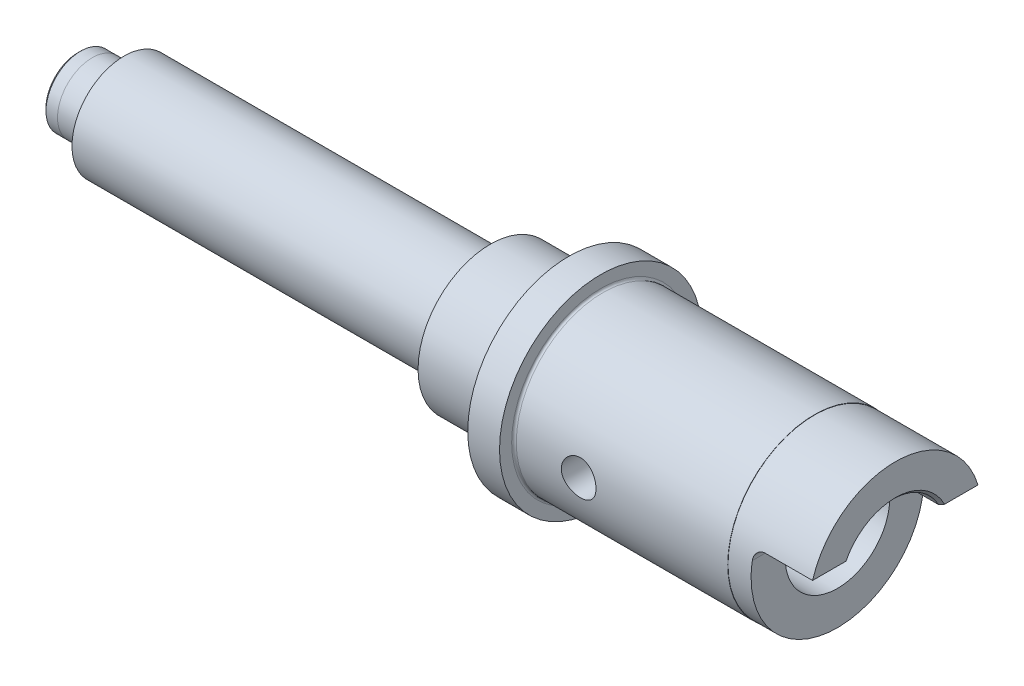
ISO-10303-21;
HEADER;
FILE_DESCRIPTION(('STEP AP214'),'2;1');
FILE_NAME('part.step','',(''),(''),'','','');
FILE_SCHEMA(('AUTOMOTIVE_DESIGN { 1 0 10303 214 1 1 1 1 }'));
ENDSEC;
DATA;
#1=APPLICATION_CONTEXT('core data for automotive mechanical design processes');
#2=APPLICATION_PROTOCOL_DEFINITION('international standard','automotive_design',2000,#1);
#3=PRODUCT_CONTEXT('',#1,'mechanical');
#4=PRODUCT('Part','Part','',(#3));
#5=PRODUCT_RELATED_PRODUCT_CATEGORY('part','',(#4));
#6=PRODUCT_DEFINITION_FORMATION('','',#4);
#7=PRODUCT_DEFINITION_CONTEXT('part definition',#1,'design');
#8=PRODUCT_DEFINITION('design','',#6,#7);
#9=PRODUCT_DEFINITION_SHAPE('','',#8);
#10=(LENGTH_UNIT() NAMED_UNIT(*) SI_UNIT(.MILLI.,.METRE.));
#11=(NAMED_UNIT(*) PLANE_ANGLE_UNIT() SI_UNIT($,.RADIAN.));
#12=(NAMED_UNIT(*) SI_UNIT($,.STERADIAN.) SOLID_ANGLE_UNIT());
#13=UNCERTAINTY_MEASURE_WITH_UNIT(LENGTH_MEASURE(1.E-05),#10,'distance_accuracy_value','');
#14=(GEOMETRIC_REPRESENTATION_CONTEXT(3) GLOBAL_UNCERTAINTY_ASSIGNED_CONTEXT((#13)) GLOBAL_UNIT_ASSIGNED_CONTEXT((#10,
#11,#12)) REPRESENTATION_CONTEXT('',''));
#15=CARTESIAN_POINT('',(0.,0.,0.));
#16=DIRECTION('',(0.,0.,1.));
#17=DIRECTION('',(1.,0.,0.));
#18=AXIS2_PLACEMENT_3D('',#15,#16,#17);
#19=CARTESIAN_POINT('',(0.,0.,0.));
#20=DIRECTION('',(1.,0.,0.));
#21=DIRECTION('',(0.,0.,-1.));
#22=AXIS2_PLACEMENT_3D('',#19,#20,#21);
#23=PLANE('',#22);
#24=CARTESIAN_POINT('',(0.,0.,0.));
#25=DIRECTION('',(-1.,0.,0.));
#26=DIRECTION('',(0.,0.,1.));
#27=AXIS2_PLACEMENT_3D('',#24,#25,#26);
#28=CIRCLE('',#27,5.495);
#29=CARTESIAN_POINT('',(0.,0.,5.495));
#30=VERTEX_POINT('',#29);
#31=EDGE_CURVE('E176',#30,#30,#28,.T.);
#32=ORIENTED_EDGE('',*,*,#31,.T.);
#33=EDGE_LOOP('',(#32));
#34=FACE_BOUND('',#33,.T.);
#35=ADVANCED_FACE('F43',(#34),#23,.F.);
#36=CARTESIAN_POINT('',(0.5,0.,0.));
#37=DIRECTION('',(1.,0.,0.));
#38=DIRECTION('',(0.,0.,-1.));
#39=AXIS2_PLACEMENT_3D('',#36,#37,#38);
#40=CONICAL_SURFACE('',#39,5.995,0.785398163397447);
#41=ORIENTED_EDGE('',*,*,#31,.F.);
#42=EDGE_LOOP('',(#41));
#43=FACE_BOUND('',#42,.T.);
#44=CARTESIAN_POINT('',(0.5,0.,0.));
#45=DIRECTION('',(-1.,0.,0.));
#46=DIRECTION('',(0.,0.,1.));
#47=AXIS2_PLACEMENT_3D('',#44,#45,#46);
#48=CIRCLE('',#47,5.995);
#49=CARTESIAN_POINT('',(0.5,0.,5.995));
#50=VERTEX_POINT('',#49);
#51=EDGE_CURVE('E173',#50,#50,#48,.T.);
#52=ORIENTED_EDGE('',*,*,#51,.T.);
#53=EDGE_LOOP('',(#52));
#54=FACE_BOUND('',#53,.T.);
#55=ADVANCED_FACE('F272',(#43,#54),#40,.T.);
#56=CARTESIAN_POINT('',(2.5,0.,0.));
#57=DIRECTION('',(1.,0.,0.));
#58=DIRECTION('',(0.,0.,-1.));
#59=AXIS2_PLACEMENT_3D('',#56,#57,#58);
#60=CONICAL_SURFACE('',#59,6.,0.00249999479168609);
#61=ORIENTED_EDGE('',*,*,#51,.F.);
#62=EDGE_LOOP('',(#61));
#63=FACE_BOUND('',#62,.T.);
#64=CARTESIAN_POINT('',(2.5,0.,0.));
#65=DIRECTION('',(-1.,0.,0.));
#66=DIRECTION('',(0.,0.,1.));
#67=AXIS2_PLACEMENT_3D('',#64,#65,#66);
#68=CIRCLE('',#67,6.);
#69=CARTESIAN_POINT('',(2.5,0.,6.));
#70=VERTEX_POINT('',#69);
#71=EDGE_CURVE('E170',#70,#70,#68,.T.);
#72=ORIENTED_EDGE('',*,*,#71,.T.);
#73=EDGE_LOOP('',(#72));
#74=FACE_BOUND('',#73,.T.);
#75=ADVANCED_FACE('F268',(#63,#74),#60,.T.);
#76=CARTESIAN_POINT('',(-32.8531956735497,0.,0.));
#77=DIRECTION('',(-1.,0.,0.));
#78=DIRECTION('',(0.,0.,1.));
#79=AXIS2_PLACEMENT_3D('',#76,#77,#78);
#80=CYLINDRICAL_SURFACE('',#79,6.);
#81=CARTESIAN_POINT('',(7.2,0.,0.));
#82=DIRECTION('',(1.,0.,0.));
#83=DIRECTION('',(0.,0.,-1.));
#84=AXIS2_PLACEMENT_3D('',#81,#82,#83);
#85=CIRCLE('',#84,6.);
#86=CARTESIAN_POINT('',(7.2,0.,-6.));
#87=VERTEX_POINT('',#86);
#88=EDGE_CURVE('E401',#87,#87,#85,.F.);
#89=ORIENTED_EDGE('',*,*,#88,.T.);
#90=EDGE_LOOP('',(#89));
#91=FACE_BOUND('',#90,.T.);
#92=ORIENTED_EDGE('',*,*,#71,.F.);
#93=EDGE_LOOP('',(#92));
#94=FACE_BOUND('',#93,.T.);
#95=ADVANCED_FACE('F264',(#91,#94),#80,.T.);
#96=CARTESIAN_POINT('',(8.,6.,0.));
#97=DIRECTION('',(1.,0.,0.));
#98=DIRECTION('',(0.,0.,-1.));
#99=AXIS2_PLACEMENT_3D('',#96,#97,#98);
#100=PLANE('',#99);
#101=CARTESIAN_POINT('',(8.,0.,0.));
#102=DIRECTION('',(1.,0.,0.));
#103=DIRECTION('',(0.,0.,-1.));
#104=AXIS2_PLACEMENT_3D('',#101,#102,#103);
#105=CIRCLE('',#104,6.8);
#106=CARTESIAN_POINT('',(8.,0.,-6.8));
#107=VERTEX_POINT('',#106);
#108=EDGE_CURVE('E399',#107,#107,#105,.T.);
#109=ORIENTED_EDGE('',*,*,#108,.T.);
#110=EDGE_LOOP('',(#109));
#111=FACE_BOUND('',#110,.T.);
#112=CARTESIAN_POINT('',(8.,0.,0.));
#113=DIRECTION('',(-1.,0.,0.));
#114=DIRECTION('',(0.,0.,1.));
#115=AXIS2_PLACEMENT_3D('',#112,#113,#114);
#116=CIRCLE('',#115,9.);
#117=CARTESIAN_POINT('',(8.,0.,9.));
#118=VERTEX_POINT('',#117);
#119=EDGE_CURVE('E167',#118,#118,#116,.T.);
#120=ORIENTED_EDGE('',*,*,#119,.T.);
#121=EDGE_LOOP('',(#120));
#122=FACE_BOUND('',#121,.T.);
#123=ADVANCED_FACE('F260',(#111,#122),#100,.F.);
#124=CARTESIAN_POINT('',(-32.8531956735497,0.,0.));
#125=DIRECTION('',(-1.,0.,0.));
#126=DIRECTION('',(0.,0.,1.));
#127=AXIS2_PLACEMENT_3D('',#124,#125,#126);
#128=CYLINDRICAL_SURFACE('',#127,9.);
#129=CARTESIAN_POINT('',(70.6,0.,0.));
#130=DIRECTION('',(1.,0.,0.));
#131=DIRECTION('',(0.,0.,-1.));
#132=AXIS2_PLACEMENT_3D('',#129,#130,#131);
#133=CIRCLE('',#132,9.);
#134=CARTESIAN_POINT('',(70.6,0.,-9.));
#135=VERTEX_POINT('',#134);
#136=EDGE_CURVE('E396',#135,#135,#133,.F.);
#137=ORIENTED_EDGE('',*,*,#136,.T.);
#138=EDGE_LOOP('',(#137));
#139=FACE_BOUND('',#138,.T.);
#140=ORIENTED_EDGE('',*,*,#119,.F.);
#141=EDGE_LOOP('',(#140));
#142=FACE_BOUND('',#141,.T.);
#143=ADVANCED_FACE('F256',(#139,#142),#128,.T.);
#144=CARTESIAN_POINT('',(71.4,9.,0.));
#145=DIRECTION('',(1.,0.,0.));
#146=DIRECTION('',(0.,0.,-1.));
#147=AXIS2_PLACEMENT_3D('',#144,#145,#146);
#148=PLANE('',#147);
#149=CARTESIAN_POINT('',(71.4,0.,0.));
#150=DIRECTION('',(1.,0.,0.));
#151=DIRECTION('',(0.,0.,-1.));
#152=AXIS2_PLACEMENT_3D('',#149,#150,#151);
#153=CIRCLE('',#152,9.8);
#154=CARTESIAN_POINT('',(71.4,0.,-9.8));
#155=VERTEX_POINT('',#154);
#156=EDGE_CURVE('E393',#155,#155,#153,.T.);
#157=ORIENTED_EDGE('',*,*,#156,.T.);
#158=EDGE_LOOP('',(#157));
#159=FACE_BOUND('',#158,.T.);
#160=CARTESIAN_POINT('',(71.4,0.,0.));
#161=DIRECTION('',(-1.,0.,0.));
#162=DIRECTION('',(0.,0.,1.));
#163=AXIS2_PLACEMENT_3D('',#160,#161,#162);
#164=CIRCLE('',#163,12.5);
#165=CARTESIAN_POINT('',(71.4,0.,12.5));
#166=VERTEX_POINT('',#165);
#167=EDGE_CURVE('E164',#166,#166,#164,.T.);
#168=ORIENTED_EDGE('',*,*,#167,.T.);
#169=EDGE_LOOP('',(#168));
#170=FACE_BOUND('',#169,.T.);
#171=ADVANCED_FACE('F252',(#159,#170),#148,.F.);
#172=CARTESIAN_POINT('',(-32.8531956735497,0.,0.));
#173=DIRECTION('',(-1.,0.,0.));
#174=DIRECTION('',(0.,0.,1.));
#175=AXIS2_PLACEMENT_3D('',#172,#173,#174);
#176=CYLINDRICAL_SURFACE('',#175,12.5);
#177=CARTESIAN_POINT('',(84.8,0.,0.));
#178=DIRECTION('',(1.,0.,0.));
#179=DIRECTION('',(0.,0.,-1.));
#180=AXIS2_PLACEMENT_3D('',#177,#178,#179);
#181=CIRCLE('',#180,12.5);
#182=CARTESIAN_POINT('',(84.8,0.,-12.5));
#183=VERTEX_POINT('',#182);
#184=EDGE_CURVE('E390',#183,#183,#181,.F.);
#185=ORIENTED_EDGE('',*,*,#184,.T.);
#186=EDGE_LOOP('',(#185));
#187=FACE_BOUND('',#186,.T.);
#188=ORIENTED_EDGE('',*,*,#167,.F.);
#189=EDGE_LOOP('',(#188));
#190=FACE_BOUND('',#189,.T.);
#191=ADVANCED_FACE('F248',(#187,#190),#176,.T.);
#192=CARTESIAN_POINT('',(85.,12.5,0.));
#193=DIRECTION('',(1.,0.,0.));
#194=DIRECTION('',(0.,0.,-1.));
#195=AXIS2_PLACEMENT_3D('',#192,#193,#194);
#196=PLANE('',#195);
#197=CARTESIAN_POINT('',(85.,0.,0.));
#198=DIRECTION('',(1.,0.,0.));
#199=DIRECTION('',(0.,0.,-1.));
#200=AXIS2_PLACEMENT_3D('',#197,#198,#199);
#201=CIRCLE('',#200,12.7);
#202=CARTESIAN_POINT('',(85.,0.,-12.7));
#203=VERTEX_POINT('',#202);
#204=EDGE_CURVE('E387',#203,#203,#201,.T.);
#205=ORIENTED_EDGE('',*,*,#204,.T.);
#206=EDGE_LOOP('',(#205));
#207=FACE_BOUND('',#206,.T.);
#208=CARTESIAN_POINT('',(85.,0.,0.));
#209=DIRECTION('',(-1.,0.,0.));
#210=DIRECTION('',(0.,0.,1.));
#211=AXIS2_PLACEMENT_3D('',#208,#209,#210);
#212=CIRCLE('',#211,17.5);
#213=CARTESIAN_POINT('',(85.,0.,17.5));
#214=VERTEX_POINT('',#213);
#215=EDGE_CURVE('E161',#214,#214,#212,.T.);
#216=ORIENTED_EDGE('',*,*,#215,.T.);
#217=EDGE_LOOP('',(#216));
#218=FACE_BOUND('',#217,.T.);
#219=ADVANCED_FACE('F244',(#207,#218),#196,.F.);
#220=CARTESIAN_POINT('',(-32.8531956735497,0.,0.));
#221=DIRECTION('',(-1.,0.,0.));
#222=DIRECTION('',(0.,0.,1.));
#223=AXIS2_PLACEMENT_3D('',#220,#221,#222);
#224=CYLINDRICAL_SURFACE('',#223,17.5);
#225=ORIENTED_EDGE('',*,*,#215,.F.);
#226=EDGE_LOOP('',(#225));
#227=FACE_BOUND('',#226,.T.);
#228=CARTESIAN_POINT('',(90.5,0.,0.));
#229=DIRECTION('',(-1.,0.,0.));
#230=DIRECTION('',(0.,0.,1.));
#231=AXIS2_PLACEMENT_3D('',#228,#229,#230);
#232=CIRCLE('',#231,17.5);
#233=CARTESIAN_POINT('',(90.5,0.,17.5));
#234=VERTEX_POINT('',#233);
#235=EDGE_CURVE('E158',#234,#234,#232,.T.);
#236=ORIENTED_EDGE('',*,*,#235,.T.);
#237=EDGE_LOOP('',(#236));
#238=FACE_BOUND('',#237,.T.);
#239=ADVANCED_FACE('F240',(#227,#238),#224,.T.);
#240=CARTESIAN_POINT('',(90.5,17.5,0.));
#241=DIRECTION('',(-1.,0.,0.));
#242=DIRECTION('',(0.,0.,1.));
#243=AXIS2_PLACEMENT_3D('',#240,#241,#242);
#244=PLANE('',#243);
#245=CARTESIAN_POINT('',(90.5,0.,0.));
#246=DIRECTION('',(-1.,0.,0.));
#247=DIRECTION('',(0.,0.,1.));
#248=AXIS2_PLACEMENT_3D('',#245,#246,#247);
#249=CIRCLE('',#248,15.4);
#250=CARTESIAN_POINT('',(90.5,0.,15.4));
#251=VERTEX_POINT('',#250);
#252=EDGE_CURVE('E382',#251,#251,#249,.T.);
#253=ORIENTED_EDGE('',*,*,#252,.T.);
#254=EDGE_LOOP('',(#253));
#255=FACE_BOUND('',#254,.T.);
#256=ORIENTED_EDGE('',*,*,#235,.F.);
#257=EDGE_LOOP('',(#256));
#258=FACE_BOUND('',#257,.T.);
#259=ADVANCED_FACE('F234',(#255,#258),#244,.F.);
#260=CARTESIAN_POINT('',(-32.8531956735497,0.,0.));
#261=DIRECTION('',(-1.,0.,0.));
#262=DIRECTION('',(0.,0.,1.));
#263=AXIS2_PLACEMENT_3D('',#260,#261,#262);
#264=CYLINDRICAL_SURFACE('',#263,15.);
#265=CARTESIAN_POINT('',(90.9,0.,0.));
#266=DIRECTION('',(-1.,0.,0.));
#267=DIRECTION('',(0.,0.,1.));
#268=AXIS2_PLACEMENT_3D('',#265,#266,#267);
#269=CIRCLE('',#268,15.);
#270=CARTESIAN_POINT('',(90.9,0.,15.));
#271=VERTEX_POINT('',#270);
#272=EDGE_CURVE('E379',#271,#271,#269,.F.);
#273=ORIENTED_EDGE('',*,*,#272,.T.);
#274=EDGE_LOOP('',(#273));
#275=FACE_BOUND('',#274,.T.);
#276=CARTESIAN_POINT('',(104.7,0.,15.));
#277=CARTESIAN_POINT('',(104.699993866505,-0.166730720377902,14.9999969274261));
#278=CARTESIAN_POINT('',(104.686053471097,-0.333538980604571,14.9971915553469));
#279=CARTESIAN_POINT('',(104.630704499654,-0.662440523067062,14.9862709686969));
#280=CARTESIAN_POINT('',(104.589274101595,-0.82452995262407,14.9781515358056));
#281=CARTESIAN_POINT('',(104.480276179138,-1.13919091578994,14.9575094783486));
#282=CARTESIAN_POINT('',(104.412733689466,-1.29177140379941,14.9449910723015));
#283=CARTESIAN_POINT('',(104.253503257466,-1.58342396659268,14.9169119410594));
#284=CARTESIAN_POINT('',(104.161816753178,-1.72249684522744,14.9013513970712));
#285=CARTESIAN_POINT('',(103.955584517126,-1.9850804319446,14.8686649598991));
#286=CARTESIAN_POINT('',(103.840774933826,-2.10838185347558,14.8515223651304));
#287=CARTESIAN_POINT('',(103.592122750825,-2.33411026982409,14.8177254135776));
#288=CARTESIAN_POINT('',(103.458278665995,-2.43653563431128,14.8010710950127));
#289=CARTESIAN_POINT('',(103.173851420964,-2.61849526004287,14.7699732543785));
#290=CARTESIAN_POINT('',(103.023127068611,-2.6978128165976,14.7555512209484));
#291=CARTESIAN_POINT('',(102.710154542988,-2.82991699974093,14.7307880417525));
#292=CARTESIAN_POINT('',(102.547907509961,-2.88270624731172,14.7204464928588));
#293=CARTESIAN_POINT('',(102.218746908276,-2.95957589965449,14.7051841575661));
#294=CARTESIAN_POINT('',(102.051922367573,-2.98402349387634,14.7001941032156));
#295=CARTESIAN_POINT('',(101.716470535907,-3.00465638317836,14.6959912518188));
#296=CARTESIAN_POINT('',(101.54784343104,-3.00084456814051,14.6967778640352));
#297=CARTESIAN_POINT('',(101.216259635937,-2.96536371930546,14.7039765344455));
#298=CARTESIAN_POINT('',(101.053255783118,-2.93411562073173,14.7103035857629));
#299=CARTESIAN_POINT('',(100.734851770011,-2.84531365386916,14.7277363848));
#300=CARTESIAN_POINT('',(100.579451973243,-2.78775852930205,14.7388423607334));
#301=CARTESIAN_POINT('',(100.279454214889,-2.64757435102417,14.7646685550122));
#302=CARTESIAN_POINT('',(100.134936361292,-2.56477845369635,14.7794126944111));
#303=CARTESIAN_POINT('',(99.8616874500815,-2.37658072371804,14.8108385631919));
#304=CARTESIAN_POINT('',(99.7329582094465,-2.27117629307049,14.827520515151));
#305=CARTESIAN_POINT('',(99.4925117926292,-2.03849980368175,14.8613106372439));
#306=CARTESIAN_POINT('',(99.3811422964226,-1.91086848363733,14.8784210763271));
#307=CARTESIAN_POINT('',(99.1813384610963,-1.63855507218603,14.9108654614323));
#308=CARTESIAN_POINT('',(99.0929044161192,-1.49387276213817,14.9261993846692));
#309=CARTESIAN_POINT('',(98.9414174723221,-1.19117816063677,14.9534007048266));
#310=CARTESIAN_POINT('',(98.8784043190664,-1.0331454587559,14.9652626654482));
#311=CARTESIAN_POINT('',(98.7799185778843,-0.708446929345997,14.9841422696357));
#312=CARTESIAN_POINT('',(98.7444426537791,-0.54178215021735,14.9911605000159));
#313=CARTESIAN_POINT('',(98.7025306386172,-0.207538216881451,14.999480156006));
#314=CARTESIAN_POINT('',(98.6956187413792,-0.0400209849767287,15.0008752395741));
#315=CARTESIAN_POINT('',(98.7097495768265,0.293774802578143,14.9980515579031));
#316=CARTESIAN_POINT('',(98.7307907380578,0.460053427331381,14.9938331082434));
#317=CARTESIAN_POINT('',(98.7998351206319,0.785116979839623,14.9803149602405));
#318=CARTESIAN_POINT('',(98.8475942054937,0.943955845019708,14.9710612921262));
#319=CARTESIAN_POINT('',(98.9684519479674,1.251370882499,14.948506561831));
#320=CARTESIAN_POINT('',(99.0415525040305,1.39994628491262,14.9352051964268));
#321=CARTESIAN_POINT('',(99.2120474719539,1.68462352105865,14.9057973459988));
#322=CARTESIAN_POINT('',(99.3097283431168,1.82055038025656,14.8896585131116));
#323=CARTESIAN_POINT('',(99.5262275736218,2.07425405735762,14.8564420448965));
#324=CARTESIAN_POINT('',(99.6450481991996,2.19202892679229,14.8393643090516));
#325=CARTESIAN_POINT('',(99.9026200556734,2.40792177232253,14.8058791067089));
#326=CARTESIAN_POINT('',(100.041647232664,2.50571310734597,14.7894858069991));
#327=CARTESIAN_POINT('',(100.33443408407,2.67655626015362,14.7595257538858));
#328=CARTESIAN_POINT('',(100.488193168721,2.74960906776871,14.7459588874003));
#329=CARTESIAN_POINT('',(100.805304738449,2.86845552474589,14.7233022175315));
#330=CARTESIAN_POINT('',(100.968602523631,2.91439049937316,14.7141892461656));
#331=CARTESIAN_POINT('',(101.300800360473,2.9781259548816,14.7014231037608));
#332=CARTESIAN_POINT('',(101.469699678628,2.99593010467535,14.6977692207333));
#333=CARTESIAN_POINT('',(101.805026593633,3.00276273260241,14.6963744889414));
#334=CARTESIAN_POINT('',(101.971443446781,2.99230736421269,14.698527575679));
#335=CARTESIAN_POINT('',(102.300094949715,2.94405691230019,14.7082672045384));
#336=CARTESIAN_POINT('',(102.462329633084,2.9062620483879,14.7158537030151));
#337=CARTESIAN_POINT('',(102.777683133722,2.80463570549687,14.7355579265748));
#338=CARTESIAN_POINT('',(102.930823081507,2.74086752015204,14.7476646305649));
#339=CARTESIAN_POINT('',(103.224311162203,2.58916393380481,14.7750514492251));
#340=CARTESIAN_POINT('',(103.364658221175,2.50122650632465,14.7903318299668));
#341=CARTESIAN_POINT('',(103.631146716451,2.30191774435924,14.8226688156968));
#342=CARTESIAN_POINT('',(103.757006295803,2.19017366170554,14.839751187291));
#343=CARTESIAN_POINT('',(103.988358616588,1.94719310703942,14.8735824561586));
#344=CARTESIAN_POINT('',(104.093846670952,1.81595216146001,14.8903312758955));
#345=CARTESIAN_POINT('',(104.282503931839,1.53605288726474,14.9218149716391));
#346=CARTESIAN_POINT('',(104.36542800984,1.38722665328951,14.9365269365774));
#347=CARTESIAN_POINT('',(104.50495836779,1.0774990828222,14.96205375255));
#348=CARTESIAN_POINT('',(104.561588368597,0.916608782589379,14.9728721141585));
#349=CARTESIAN_POINT('',(104.635955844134,0.629464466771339,14.9872911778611));
#350=CARTESIAN_POINT('',(104.659929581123,0.504844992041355,14.9920290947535));
#351=CARTESIAN_POINT('',(104.691953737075,0.253498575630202,14.9983846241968));
#352=CARTESIAN_POINT('',(104.700004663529,0.126771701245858,15.0000023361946));
#353=CARTESIAN_POINT('',(104.7,0.,15.));
#354=B_SPLINE_CURVE_WITH_KNOTS('',3,(#276,#277,#278,#279,#280,#281,#282,#283,#284,#285,#286,
#287,#288,#289,#290,#291,#292,#293,#294,#295,#296,#297,#298,#299,#300,#301,#302,#303,#304,#305,
#306,#307,#308,#309,#310,#311,#312,#313,#314,#315,#316,#317,#318,#319,#320,#321,#322,#323,#324,
#325,#326,#327,#328,#329,#330,#331,#332,#333,#334,#335,#336,#337,#338,#339,#340,#341,#342,#343,
#344,#345,#346,#347,#348,#349,#350,#351,#352,#353),.UNSPECIFIED.,.T.,.F.,(4,2,2,2,2,2,2,2,2,2,2,
2,2,2,2,2,2,2,2,2,2,2,2,2,2,2,2,2,2,2,2,2,2,2,2,2,2,2,4),(0.,0.499728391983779,
0.999853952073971,1.49950120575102,1.99911870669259,2.50479801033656,3.0105167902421,
3.52083585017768,4.03110448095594,4.53468555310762,5.03821512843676,5.53415181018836,
6.0301121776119,6.52942470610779,7.02879464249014,7.53714757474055,8.04550702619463,
8.55465824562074,9.0637477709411,9.56432207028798,10.0648682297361,10.5609136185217,
11.0569961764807,11.5591519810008,12.0613616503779,12.5712188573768,13.081055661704,
13.5882114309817,14.0953010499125,14.5931916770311,15.0910783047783,15.5877588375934,
16.0844810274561,16.5896422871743,17.094919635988,17.6054849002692,18.1155886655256,
18.4955632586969,18.8755257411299),.UNSPECIFIED.);
#355=CARTESIAN_POINT('',(104.7,0.,15.));
#356=VERTEX_POINT('',#355);
#357=EDGE_CURVE('E224',#356,#356,#354,.T.);
#358=ORIENTED_EDGE('',*,*,#357,.T.);
#359=EDGE_LOOP('',(#358));
#360=FACE_BOUND('',#359,.T.);
#361=CARTESIAN_POINT('',(104.7,0.,-15.));
#362=CARTESIAN_POINT('',(104.699993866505,0.1667307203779,-14.9999969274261));
#363=CARTESIAN_POINT('',(104.686053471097,0.333538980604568,-14.9971915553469));
#364=CARTESIAN_POINT('',(104.630704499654,0.662440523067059,-14.9862709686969));
#365=CARTESIAN_POINT('',(104.589274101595,0.824529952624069,-14.9781515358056));
#366=CARTESIAN_POINT('',(104.480276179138,1.13919091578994,-14.9575094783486));
#367=CARTESIAN_POINT('',(104.412733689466,1.2917714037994,-14.9449910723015));
#368=CARTESIAN_POINT('',(104.253503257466,1.58342396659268,-14.9169119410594));
#369=CARTESIAN_POINT('',(104.161816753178,1.72249684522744,-14.9013513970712));
#370=CARTESIAN_POINT('',(103.955584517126,1.9850804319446,-14.8686649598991));
#371=CARTESIAN_POINT('',(103.840774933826,2.10838185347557,-14.8515223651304));
#372=CARTESIAN_POINT('',(103.592122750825,2.33411026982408,-14.8177254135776));
#373=CARTESIAN_POINT('',(103.458278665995,2.43653563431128,-14.8010710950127));
#374=CARTESIAN_POINT('',(103.173851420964,2.61849526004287,-14.7699732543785));
#375=CARTESIAN_POINT('',(103.023127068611,2.69781281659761,-14.7555512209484));
#376=CARTESIAN_POINT('',(102.710154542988,2.82991699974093,-14.7307880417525));
#377=CARTESIAN_POINT('',(102.547907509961,2.88270624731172,-14.7204464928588));
#378=CARTESIAN_POINT('',(102.218746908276,2.95957589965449,-14.7051841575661));
#379=CARTESIAN_POINT('',(102.051922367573,2.98402349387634,-14.7001941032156));
#380=CARTESIAN_POINT('',(101.716470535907,3.00465638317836,-14.6959912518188));
#381=CARTESIAN_POINT('',(101.54784343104,3.00084456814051,-14.6967778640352));
#382=CARTESIAN_POINT('',(101.216259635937,2.96536371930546,-14.7039765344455));
#383=CARTESIAN_POINT('',(101.053255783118,2.93411562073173,-14.7103035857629));
#384=CARTESIAN_POINT('',(100.734851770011,2.84531365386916,-14.7277363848));
#385=CARTESIAN_POINT('',(100.579451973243,2.78775852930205,-14.7388423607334));
#386=CARTESIAN_POINT('',(100.279454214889,2.64757435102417,-14.7646685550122));
#387=CARTESIAN_POINT('',(100.134936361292,2.56477845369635,-14.7794126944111));
#388=CARTESIAN_POINT('',(99.8616874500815,2.37658072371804,-14.8108385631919));
#389=CARTESIAN_POINT('',(99.7329582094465,2.27117629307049,-14.827520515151));
#390=CARTESIAN_POINT('',(99.4925117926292,2.03849980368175,-14.8613106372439));
#391=CARTESIAN_POINT('',(99.3811422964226,1.91086848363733,-14.8784210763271));
#392=CARTESIAN_POINT('',(99.1813384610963,1.63855507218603,-14.9108654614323));
#393=CARTESIAN_POINT('',(99.0929044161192,1.49387276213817,-14.9261993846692));
#394=CARTESIAN_POINT('',(98.9414174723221,1.19117816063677,-14.9534007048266));
#395=CARTESIAN_POINT('',(98.8784043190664,1.0331454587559,-14.9652626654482));
#396=CARTESIAN_POINT('',(98.7799185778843,0.708446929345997,-14.9841422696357));
#397=CARTESIAN_POINT('',(98.7444426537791,0.54178215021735,-14.9911605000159));
#398=CARTESIAN_POINT('',(98.7025306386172,0.207538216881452,-14.999480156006));
#399=CARTESIAN_POINT('',(98.6956187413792,0.0400209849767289,-15.0008752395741));
#400=CARTESIAN_POINT('',(98.7097495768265,-0.293774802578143,-14.9980515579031));
#401=CARTESIAN_POINT('',(98.7307907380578,-0.460053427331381,-14.9938331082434));
#402=CARTESIAN_POINT('',(98.7998351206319,-0.785116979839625,-14.9803149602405));
#403=CARTESIAN_POINT('',(98.8475942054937,-0.943955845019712,-14.9710612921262));
#404=CARTESIAN_POINT('',(98.9684519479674,-1.251370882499,-14.948506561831));
#405=CARTESIAN_POINT('',(99.0415525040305,-1.39994628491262,-14.9352051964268));
#406=CARTESIAN_POINT('',(99.2120474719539,-1.68462352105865,-14.9057973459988));
#407=CARTESIAN_POINT('',(99.3097283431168,-1.82055038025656,-14.8896585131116));
#408=CARTESIAN_POINT('',(99.5262275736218,-2.07425405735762,-14.8564420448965));
#409=CARTESIAN_POINT('',(99.6450481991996,-2.19202892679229,-14.8393643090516));
#410=CARTESIAN_POINT('',(99.9026200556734,-2.40792177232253,-14.8058791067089));
#411=CARTESIAN_POINT('',(100.041647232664,-2.50571310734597,-14.7894858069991));
#412=CARTESIAN_POINT('',(100.33443408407,-2.67655626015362,-14.7595257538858));
#413=CARTESIAN_POINT('',(100.488193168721,-2.74960906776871,-14.7459588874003));
#414=CARTESIAN_POINT('',(100.805304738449,-2.86845552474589,-14.7233022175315));
#415=CARTESIAN_POINT('',(100.968602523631,-2.91439049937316,-14.7141892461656));
#416=CARTESIAN_POINT('',(101.300800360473,-2.9781259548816,-14.7014231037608));
#417=CARTESIAN_POINT('',(101.469699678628,-2.99593010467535,-14.6977692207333));
#418=CARTESIAN_POINT('',(101.805026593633,-3.00276273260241,-14.6963744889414));
#419=CARTESIAN_POINT('',(101.971443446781,-2.99230736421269,-14.698527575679));
#420=CARTESIAN_POINT('',(102.300094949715,-2.94405691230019,-14.7082672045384));
#421=CARTESIAN_POINT('',(102.462329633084,-2.9062620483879,-14.7158537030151));
#422=CARTESIAN_POINT('',(102.777683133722,-2.80463570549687,-14.7355579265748));
#423=CARTESIAN_POINT('',(102.930823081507,-2.74086752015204,-14.7476646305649));
#424=CARTESIAN_POINT('',(103.224311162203,-2.58916393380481,-14.7750514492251));
#425=CARTESIAN_POINT('',(103.364658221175,-2.50122650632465,-14.7903318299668));
#426=CARTESIAN_POINT('',(103.631146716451,-2.30191774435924,-14.8226688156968));
#427=CARTESIAN_POINT('',(103.757006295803,-2.19017366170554,-14.839751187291));
#428=CARTESIAN_POINT('',(103.988358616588,-1.94719310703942,-14.8735824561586));
#429=CARTESIAN_POINT('',(104.093846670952,-1.81595216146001,-14.8903312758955));
#430=CARTESIAN_POINT('',(104.282503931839,-1.53605288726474,-14.9218149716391));
#431=CARTESIAN_POINT('',(104.36542800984,-1.38722665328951,-14.9365269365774));
#432=CARTESIAN_POINT('',(104.50495836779,-1.0774990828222,-14.96205375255));
#433=CARTESIAN_POINT('',(104.561588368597,-0.916608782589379,-14.9728721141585));
#434=CARTESIAN_POINT('',(104.635955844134,-0.629464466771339,-14.9872911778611));
#435=CARTESIAN_POINT('',(104.659929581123,-0.504844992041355,-14.9920290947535));
#436=CARTESIAN_POINT('',(104.691953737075,-0.253498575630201,-14.9983846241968));
#437=CARTESIAN_POINT('',(104.700004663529,-0.126771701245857,-15.0000023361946));
#438=CARTESIAN_POINT('',(104.7,0.,-15.));
#439=B_SPLINE_CURVE_WITH_KNOTS('',3,(#361,#362,#363,#364,#365,#366,#367,#368,#369,#370,#371,
#372,#373,#374,#375,#376,#377,#378,#379,#380,#381,#382,#383,#384,#385,#386,#387,#388,#389,#390,
#391,#392,#393,#394,#395,#396,#397,#398,#399,#400,#401,#402,#403,#404,#405,#406,#407,#408,#409,
#410,#411,#412,#413,#414,#415,#416,#417,#418,#419,#420,#421,#422,#423,#424,#425,#426,#427,#428,
#429,#430,#431,#432,#433,#434,#435,#436,#437,#438),.UNSPECIFIED.,.T.,.F.,(4,2,2,2,2,2,2,2,2,2,2,
2,2,2,2,2,2,2,2,2,2,2,2,2,2,2,2,2,2,2,2,2,2,2,2,2,2,2,4),(0.,0.499728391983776,
0.999853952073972,1.49950120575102,1.99911870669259,2.50479801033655,3.0105167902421,
3.52083585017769,4.03110448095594,4.53468555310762,5.03821512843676,5.53415181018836,
6.0301121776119,6.52942470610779,7.02879464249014,7.53714757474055,8.04550702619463,
8.55465824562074,9.0637477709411,9.56432207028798,10.0648682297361,10.5609136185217,
11.0569961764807,11.5591519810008,12.0613616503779,12.5712188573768,13.081055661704,
13.5882114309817,14.0953010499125,14.5931916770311,15.0910783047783,15.5877588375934,
16.0844810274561,16.5896422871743,17.094919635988,17.6054849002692,18.1155886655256,
18.4955632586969,18.8755257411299),.UNSPECIFIED.);
#440=CARTESIAN_POINT('',(104.7,0.,-15.));
#441=VERTEX_POINT('',#440);
#442=EDGE_CURVE('E219',#441,#441,#439,.T.);
#443=ORIENTED_EDGE('',*,*,#442,.T.);
#444=EDGE_LOOP('',(#443));
#445=FACE_BOUND('',#444,.T.);
#446=CARTESIAN_POINT('',(127.5,0.,0.));
#447=DIRECTION('',(-1.,0.,0.));
#448=DIRECTION('',(0.,0.,1.));
#449=AXIS2_PLACEMENT_3D('',#446,#447,#448);
#450=CIRCLE('',#449,15.);
#451=CARTESIAN_POINT('',(127.5,0.,15.));
#452=VERTEX_POINT('',#451);
#453=EDGE_CURVE('E155',#452,#452,#450,.T.);
#454=ORIENTED_EDGE('',*,*,#453,.T.);
#455=EDGE_LOOP('',(#454));
#456=FACE_BOUND('',#455,.T.);
#457=ADVANCED_FACE('F228',(#275,#360,#445,#456),#264,.T.);
#458=CARTESIAN_POINT('',(127.5,15.,0.));
#459=DIRECTION('',(-1.,0.,0.));
#460=DIRECTION('',(0.,0.,1.));
#461=AXIS2_PLACEMENT_3D('',#458,#459,#460);
#462=PLANE('',#461);
#463=ORIENTED_EDGE('',*,*,#453,.F.);
#464=EDGE_LOOP('',(#463));
#465=FACE_BOUND('',#464,.T.);
#466=CARTESIAN_POINT('',(127.5,0.,0.));
#467=DIRECTION('',(-1.,0.,0.));
#468=DIRECTION('',(0.,0.,1.));
#469=AXIS2_PLACEMENT_3D('',#466,#467,#468);
#470=CIRCLE('',#469,14.95);
#471=CARTESIAN_POINT('',(127.5,0.,14.95));
#472=VERTEX_POINT('',#471);
#473=EDGE_CURVE('E152',#472,#472,#470,.T.);
#474=ORIENTED_EDGE('',*,*,#473,.T.);
#475=EDGE_LOOP('',(#474));
#476=FACE_BOUND('',#475,.T.);
#477=ADVANCED_FACE('F233',(#465,#476),#462,.F.);
#478=CARTESIAN_POINT('',(-32.8531956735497,0.,0.));
#479=DIRECTION('',(-1.,0.,0.));
#480=DIRECTION('',(0.,0.,1.));
#481=AXIS2_PLACEMENT_3D('',#478,#479,#480);
#482=CYLINDRICAL_SURFACE('',#481,14.95);
#483=ORIENTED_EDGE('',*,*,#473,.F.);
#484=EDGE_LOOP('',(#483));
#485=FACE_BOUND('',#484,.T.);
#486=CARTESIAN_POINT('',(141.5,0.,0.));
#487=DIRECTION('',(-1.,0.,0.));
#488=DIRECTION('',(0.,0.,1.));
#489=AXIS2_PLACEMENT_3D('',#486,#487,#488);
#490=CIRCLE('',#489,14.95);
#491=CARTESIAN_POINT('',(141.5,4.3,14.3182575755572));
#492=VERTEX_POINT('',#491);
#493=CARTESIAN_POINT('',(141.5,4.3,-14.3182575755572));
#494=VERTEX_POINT('',#493);
#495=EDGE_CURVE('E145',#492,#494,#490,.T.);
#496=ORIENTED_EDGE('',*,*,#495,.T.);
#497=DIRECTION('',(-1.,0.,0.));
#498=VECTOR('',#497,1.);
#499=CARTESIAN_POINT('',(-32.8531956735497,4.3,-14.3182575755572));
#500=LINE('',#499,#498);
#501=CARTESIAN_POINT('',(133.3,4.3,-14.3182575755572));
#502=VERTEX_POINT('',#501);
#503=EDGE_CURVE('E352',#494,#502,#500,.T.);
#504=ORIENTED_EDGE('',*,*,#503,.T.);
#505=CARTESIAN_POINT('',(133.3,4.3,-14.3182575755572));
#506=CARTESIAN_POINT('',(133.250717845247,4.30000082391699,-14.3182558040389));
#507=CARTESIAN_POINT('',(133.201460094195,4.29797472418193,-14.3188659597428));
#508=CARTESIAN_POINT('',(133.103313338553,4.2898994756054,-14.3212879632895));
#509=CARTESIAN_POINT('',(133.054424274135,4.28385099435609,-14.3230996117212));
#510=CARTESIAN_POINT('',(132.90906196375,4.25976630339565,-14.3302891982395));
#511=CARTESIAN_POINT('',(132.813588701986,4.23579040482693,-14.337422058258));
#512=CARTESIAN_POINT('',(132.628240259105,4.17282219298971,-14.3558739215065));
#513=CARTESIAN_POINT('',(132.538364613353,4.13383112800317,-14.3671925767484));
#514=CARTESIAN_POINT('',(132.366464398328,4.04207745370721,-14.393275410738));
#515=CARTESIAN_POINT('',(132.284441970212,3.98931110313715,-14.4080405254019));
#516=CARTESIAN_POINT('',(132.128565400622,3.87024620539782,-14.4404838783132));
#517=CARTESIAN_POINT('',(132.054933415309,3.80367287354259,-14.4582195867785));
#518=CARTESIAN_POINT('',(131.919748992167,3.65959884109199,-14.495356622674));
#519=CARTESIAN_POINT('',(131.858200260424,3.58209480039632,-14.514758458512));
#520=CARTESIAN_POINT('',(131.746727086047,3.41529148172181,-14.5549266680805));
#521=CARTESIAN_POINT('',(131.697289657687,3.32567241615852,-14.575717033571));
#522=CARTESIAN_POINT('',(131.614278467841,3.13932444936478,-14.6169843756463));
#523=CARTESIAN_POINT('',(131.58069709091,3.04259898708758,-14.6374614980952));
#524=CARTESIAN_POINT('',(131.53714198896,2.87135243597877,-14.6718530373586));
#525=CARTESIAN_POINT('',(131.523247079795,2.79786133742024,-14.6860505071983));
#526=CARTESIAN_POINT('',(131.504672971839,2.6496258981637,-14.7135223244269));
#527=CARTESIAN_POINT('',(131.499985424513,2.57488275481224,-14.7267974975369));
#528=CARTESIAN_POINT('',(131.5,2.5,-14.7394877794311));
#529=B_SPLINE_CURVE_WITH_KNOTS('',3,(#505,#506,#507,#508,#509,#510,#511,#512,#513,#514,#515,
#516,#517,#518,#519,#520,#521,#522,#523,#524,#525,#526,#527,#528),.UNSPECIFIED.,.F.,.F.,(4,2,2,
2,2,2,2,2,2,2,2,4),(0.,0.147753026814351,0.295481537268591,0.590035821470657,0.884565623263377,
1.1791755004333,1.48033559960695,1.78158792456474,2.09347410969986,2.40521034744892,
2.63304968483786,2.86068233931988),.UNSPECIFIED.);
#530=CARTESIAN_POINT('',(131.5,2.5,-14.7394877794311));
#531=VERTEX_POINT('',#530);
#532=EDGE_CURVE('E329',#502,#531,#529,.T.);
#533=ORIENTED_EDGE('',*,*,#532,.T.);
#534=CARTESIAN_POINT('',(131.5,0.,0.));
#535=DIRECTION('',(-1.,0.,0.));
#536=DIRECTION('',(0.,0.,1.));
#537=AXIS2_PLACEMENT_3D('',#534,#535,#536);
#538=CIRCLE('',#537,14.95);
#539=CARTESIAN_POINT('',(131.5,2.5,14.7394877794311));
#540=VERTEX_POINT('',#539);
#541=EDGE_CURVE('E143',#531,#540,#538,.T.);
#542=ORIENTED_EDGE('',*,*,#541,.T.);
#543=CARTESIAN_POINT('',(131.5,2.5,14.7394877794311));
#544=CARTESIAN_POINT('',(131.500000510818,2.55164448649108,14.7307298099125));
#545=CARTESIAN_POINT('',(131.502223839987,2.603215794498,14.7217015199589));
#546=CARTESIAN_POINT('',(131.511070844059,2.7058877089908,14.7031760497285));
#547=CARTESIAN_POINT('',(131.517693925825,2.75698837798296,14.6936789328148));
#548=CARTESIAN_POINT('',(131.544063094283,2.90893056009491,14.664624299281));
#549=CARTESIAN_POINT('',(131.570309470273,3.00860644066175,14.644470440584));
#550=CARTESIAN_POINT('',(131.639296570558,3.20185991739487,14.6034373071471));
#551=CARTESIAN_POINT('',(131.682038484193,3.29543707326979,14.5825579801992));
#552=CARTESIAN_POINT('',(131.782837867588,3.47402604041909,14.541047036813));
#553=CARTESIAN_POINT('',(131.840895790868,3.5590375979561,14.5204154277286));
#554=CARTESIAN_POINT('',(131.971228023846,3.71862497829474,14.4803712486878));
#555=CARTESIAN_POINT('',(132.04358870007,3.79313244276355,14.4609670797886));
#556=CARTESIAN_POINT('',(132.200425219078,3.92887593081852,14.4246796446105));
#557=CARTESIAN_POINT('',(132.284902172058,3.99011073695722,14.4077966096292));
#558=CARTESIAN_POINT('',(132.462021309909,4.0963290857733,14.3779549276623));
#559=CARTESIAN_POINT('',(132.554488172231,4.14158653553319,14.3649308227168));
#560=CARTESIAN_POINT('',(132.74619873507,4.21576145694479,14.3433386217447));
#561=CARTESIAN_POINT('',(132.84543466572,4.24469732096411,14.3347655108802));
#562=CARTESIAN_POINT('',(133.004611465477,4.27659027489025,14.3252719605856));
#563=CARTESIAN_POINT('',(133.063347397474,4.28536120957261,14.3226478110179));
#564=CARTESIAN_POINT('',(133.181378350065,4.2970653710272,14.3191390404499));
#565=CARTESIAN_POINT('',(133.240672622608,4.30000552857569,14.318252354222));
#566=CARTESIAN_POINT('',(133.3,4.3,14.3182575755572));
#567=B_SPLINE_CURVE_WITH_KNOTS('',3,(#543,#544,#545,#546,#547,#548,#549,#550,#551,#552,#553,
#554,#555,#556,#557,#558,#559,#560,#561,#562,#563,#564,#565,#566),.UNSPECIFIED.,.F.,.F.,(4,2,2,
2,2,2,2,2,2,2,2,4),(0.,0.157045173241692,0.314069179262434,0.627533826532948,0.941021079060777,
1.25451761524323,1.56996843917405,1.88544818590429,2.19522178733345,2.50464561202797,
2.68269596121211,2.86053454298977),.UNSPECIFIED.);
#568=CARTESIAN_POINT('',(133.3,4.3,14.3182575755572));
#569=VERTEX_POINT('',#568);
#570=EDGE_CURVE('E303',#540,#569,#567,.T.);
#571=ORIENTED_EDGE('',*,*,#570,.T.);
#572=DIRECTION('',(-1.,0.,0.));
#573=VECTOR('',#572,1.);
#574=CARTESIAN_POINT('',(-32.8531956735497,4.3,14.3182575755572));
#575=LINE('',#574,#573);
#576=EDGE_CURVE('E146',#569,#492,#575,.F.);
#577=ORIENTED_EDGE('',*,*,#576,.T.);
#578=EDGE_LOOP('',(#496,#504,#533,#542,#571,#577));
#579=FACE_BOUND('',#578,.T.);
#580=ADVANCED_FACE('F337',(#485,#579),#482,.T.);
#581=CARTESIAN_POINT('',(141.5,14.95,0.));
#582=DIRECTION('',(-1.,0.,0.));
#583=DIRECTION('',(0.,0.,1.));
#584=AXIS2_PLACEMENT_3D('',#581,#582,#583);
#585=PLANE('',#584);
#586=DIRECTION('',(0.,0.,-1.));
#587=VECTOR('',#586,1.);
#588=CARTESIAN_POINT('',(141.5,4.3,0.));
#589=LINE('',#588,#587);
#590=CARTESIAN_POINT('',(141.5,4.3,8.52716248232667));
#591=VERTEX_POINT('',#590);
#592=EDGE_CURVE('E355',#492,#591,#589,.T.);
#593=ORIENTED_EDGE('',*,*,#592,.T.);
#594=CARTESIAN_POINT('',(141.5,0.,0.));
#595=DIRECTION('',(-1.,0.,0.));
#596=DIRECTION('',(0.,0.,1.));
#597=AXIS2_PLACEMENT_3D('',#594,#595,#596);
#598=CIRCLE('',#597,9.54999999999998);
#599=CARTESIAN_POINT('',(141.5,4.3,-8.52716248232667));
#600=VERTEX_POINT('',#599);
#601=EDGE_CURVE('E56',#591,#600,#598,.T.);
#602=ORIENTED_EDGE('',*,*,#601,.T.);
#603=EDGE_CURVE('E356',#600,#494,#589,.T.);
#604=ORIENTED_EDGE('',*,*,#603,.T.);
#605=ORIENTED_EDGE('',*,*,#495,.F.);
#606=EDGE_LOOP('',(#593,#602,#604,#605));
#607=FACE_BOUND('',#606,.T.);
#608=ADVANCED_FACE('F319',(#607),#585,.F.);
#609=CARTESIAN_POINT('',(141.5,0.,0.));
#610=DIRECTION('',(1.,0.,0.));
#611=DIRECTION('',(0.,0.,-1.));
#612=AXIS2_PLACEMENT_3D('',#609,#610,#611);
#613=CYLINDRICAL_SURFACE('',#612,9.04999999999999);
#614=CARTESIAN_POINT('',(99.5,0.,0.));
#615=DIRECTION('',(1.,0.,0.));
#616=DIRECTION('',(0.,0.,-1.));
#617=AXIS2_PLACEMENT_3D('',#614,#615,#616);
#618=CIRCLE('',#617,9.04999999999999);
#619=CARTESIAN_POINT('',(99.5,2.03960780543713,-8.81717074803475));
#620=VERTEX_POINT('',#619);
#621=CARTESIAN_POINT('',(99.5000000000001,2.03960780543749,8.81717074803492));
#622=VERTEX_POINT('',#621);
#623=EDGE_CURVE('E138',#620,#622,#618,.T.);
#624=ORIENTED_EDGE('',*,*,#623,.F.);
#625=CARTESIAN_POINT('',(99.5,2.03960780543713,-8.81717074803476));
#626=CARTESIAN_POINT('',(99.5571446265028,2.10124062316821,-8.80291447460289));
#627=CARTESIAN_POINT('',(99.6168337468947,2.16043117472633,-8.78854068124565));
#628=CARTESIAN_POINT('',(99.7409904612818,2.27362056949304,-8.75994031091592));
#629=CARTESIAN_POINT('',(99.8054585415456,2.32761888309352,-8.74571374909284));
#630=CARTESIAN_POINT('',(100.005646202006,2.48142263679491,-8.70381211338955));
#631=CARTESIAN_POINT('',(100.148063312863,2.572944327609,-8.67693742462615));
#632=CARTESIAN_POINT('',(100.447135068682,2.73111902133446,-8.62846381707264));
#633=CARTESIAN_POINT('',(100.603809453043,2.79773687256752,-8.60687237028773));
#634=CARTESIAN_POINT('',(100.926868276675,2.90363439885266,-8.57172959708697));
#635=CARTESIAN_POINT('',(101.093241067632,2.94294616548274,-8.55816883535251));
#636=CARTESIAN_POINT('',(101.424768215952,2.99187718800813,-8.5411841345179));
#637=CARTESIAN_POINT('',(101.589757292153,3.00249809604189,-8.5374184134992));
#638=CARTESIAN_POINT('',(101.919212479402,2.99651228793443,-8.53952142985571));
#639=CARTESIAN_POINT('',(102.08367850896,2.97990151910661,-8.54539160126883));
#640=CARTESIAN_POINT('',(102.401936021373,2.92107020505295,-8.56567311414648));
#641=CARTESIAN_POINT('',(102.555900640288,2.87968086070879,-8.57980690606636));
#642=CARTESIAN_POINT('',(102.854673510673,2.77342373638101,-8.6147389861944));
#643=CARTESIAN_POINT('',(102.999480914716,2.70855378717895,-8.635537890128));
#644=CARTESIAN_POINT('',(103.281160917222,2.55470854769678,-8.68231633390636));
#645=CARTESIAN_POINT('',(103.417609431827,2.46500329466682,-8.70844516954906));
#646=CARTESIAN_POINT('',(103.673990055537,2.26491142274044,-8.76261394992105));
#647=CARTESIAN_POINT('',(103.793916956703,2.15451830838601,-8.79065449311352));
#648=CARTESIAN_POINT('',(104.019601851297,1.9100736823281,-8.84706423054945));
#649=CARTESIAN_POINT('',(104.124440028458,1.77515988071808,-8.87538792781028));
#650=CARTESIAN_POINT('',(104.310019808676,1.48891949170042,-8.92786418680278));
#651=CARTESIAN_POINT('',(104.39076284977,1.33759388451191,-8.95201699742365));
#652=CARTESIAN_POINT('',(104.524949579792,1.02395621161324,-8.99326326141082));
#653=CARTESIAN_POINT('',(104.578627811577,0.861752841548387,-9.010417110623));
#654=CARTESIAN_POINT('',(104.657737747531,0.529950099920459,-9.0359997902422));
#655=CARTESIAN_POINT('',(104.683179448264,0.360353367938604,-9.04443170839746));
#656=CARTESIAN_POINT('',(104.704304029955,0.0270792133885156,-9.05142298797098));
#657=CARTESIAN_POINT('',(104.701318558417,-0.136505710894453,-9.05042414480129));
#658=CARTESIAN_POINT('',(104.668883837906,-0.460724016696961,-9.03972004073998));
#659=CARTESIAN_POINT('',(104.639436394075,-0.621357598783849,-9.03001537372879));
#660=CARTESIAN_POINT('',(104.555746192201,-0.932947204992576,-9.00312468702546));
#661=CARTESIAN_POINT('',(104.501849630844,-1.08400586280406,-8.98604327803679));
#662=CARTESIAN_POINT('',(104.371104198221,-1.37501353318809,-8.94614073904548));
#663=CARTESIAN_POINT('',(104.29425100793,-1.51496044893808,-8.92331852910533));
#664=CARTESIAN_POINT('',(104.116417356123,-1.78553023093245,-8.87322013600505));
#665=CARTESIAN_POINT('',(104.014634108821,-1.91560004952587,-8.84580811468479));
#666=CARTESIAN_POINT('',(103.791262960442,-2.15724551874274,-8.7900057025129));
#667=CARTESIAN_POINT('',(103.669669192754,-2.2688156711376,-8.761615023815));
#668=CARTESIAN_POINT('',(103.404676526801,-2.47451866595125,-8.70580597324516));
#669=CARTESIAN_POINT('',(103.260632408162,-2.56784372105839,-8.67846362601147));
#670=CARTESIAN_POINT('',(102.95801367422,-2.7288754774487,-8.62918687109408));
#671=CARTESIAN_POINT('',(102.799441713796,-2.79658684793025,-8.60725147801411));
#672=CARTESIAN_POINT('',(102.475583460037,-2.90291258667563,-8.57197162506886));
#673=CARTESIAN_POINT('',(102.310505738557,-2.94210348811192,-8.55845778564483));
#674=CARTESIAN_POINT('',(101.975635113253,-2.99209859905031,-8.54111079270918));
#675=CARTESIAN_POINT('',(101.805844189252,-3.00291455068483,-8.53727363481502));
#676=CARTESIAN_POINT('',(101.475565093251,-2.99591932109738,-8.53972828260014));
#677=CARTESIAN_POINT('',(101.315040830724,-2.97952864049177,-8.54551750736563));
#678=CARTESIAN_POINT('',(100.999172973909,-2.92140927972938,-8.56555877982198));
#679=CARTESIAN_POINT('',(100.843830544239,-2.87967494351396,-8.57981271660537));
#680=CARTESIAN_POINT('',(100.542286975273,-2.77225193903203,-8.61512032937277));
#681=CARTESIAN_POINT('',(100.396099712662,-2.70652789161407,-8.63618404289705));
#682=CARTESIAN_POINT('',(100.116612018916,-2.55308868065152,-8.68277763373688));
#683=CARTESIAN_POINT('',(99.98330408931,-2.46538642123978,-8.70830488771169));
#684=CARTESIAN_POINT('',(99.7938907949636,-2.31805043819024,-8.74824603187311));
#685=CARTESIAN_POINT('',(99.7318914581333,-2.26564241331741,-8.76199511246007));
#686=CARTESIAN_POINT('',(99.6124792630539,-2.15610737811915,-8.78958968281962));
#687=CARTESIAN_POINT('',(99.5550571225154,-2.09899042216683,-8.80343491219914));
#688=CARTESIAN_POINT('',(99.5,-2.03960780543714,-8.81717074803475));
#689=B_SPLINE_CURVE_WITH_KNOTS('',3,(#625,#626,#627,#628,#629,#630,#631,#632,#633,#634,#635,
#636,#637,#638,#639,#640,#641,#642,#643,#644,#645,#646,#647,#648,#649,#650,#651,#652,#653,#654,
#655,#656,#657,#658,#659,#660,#661,#662,#663,#664,#665,#666,#667,#668,#669,#670,#671,#672,#673,
#674,#675,#676,#677,#678,#679,#680,#681,#682,#683,#684,#685,#686,#687,#688),.UNSPECIFIED.,.F.,
.F.,(4,2,2,2,2,2,2,2,2,2,2,2,2,2,2,2,2,2,2,2,2,2,2,2,2,2,2,2,2,2,2,4),(0.,0.255592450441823,
0.511210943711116,1.02282789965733,1.53516429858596,2.04689754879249,2.54051922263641,
3.03421436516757,3.51220977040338,3.99024934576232,4.48418803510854,4.97828206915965,
5.49538366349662,6.01245439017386,6.52496367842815,7.03729146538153,7.52574225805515,
8.01415973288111,8.49586730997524,8.97766557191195,9.47769121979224,9.97786521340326,
10.4967374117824,11.0155149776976,11.5234899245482,12.0312546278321,12.5133326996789,
12.9955183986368,13.478418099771,13.9610349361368,14.2078215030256,14.4540941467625),.UNSPECIFIED.);
#690=CARTESIAN_POINT('',(99.5000000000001,-2.03960780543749,-8.81717074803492));
#691=VERTEX_POINT('',#690);
#692=EDGE_CURVE('E124',#620,#691,#689,.T.);
#693=ORIENTED_EDGE('',*,*,#692,.T.);
#694=CARTESIAN_POINT('',(99.5,-2.03960780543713,8.81717074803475));
#695=VERTEX_POINT('',#694);
#696=EDGE_CURVE('E137',#695,#691,#618,.T.);
#697=ORIENTED_EDGE('',*,*,#696,.F.);
#698=CARTESIAN_POINT('',(99.5,-2.03960780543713,8.81717074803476));
#699=CARTESIAN_POINT('',(99.5571446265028,-2.10124062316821,8.80291447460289));
#700=CARTESIAN_POINT('',(99.6168337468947,-2.16043117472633,8.78854068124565));
#701=CARTESIAN_POINT('',(99.7409904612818,-2.27362056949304,8.75994031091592));
#702=CARTESIAN_POINT('',(99.8054585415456,-2.32761888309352,8.74571374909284));
#703=CARTESIAN_POINT('',(100.005646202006,-2.48142263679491,8.70381211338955));
#704=CARTESIAN_POINT('',(100.148063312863,-2.572944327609,8.67693742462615));
#705=CARTESIAN_POINT('',(100.447135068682,-2.73111902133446,8.62846381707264));
#706=CARTESIAN_POINT('',(100.603809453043,-2.79773687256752,8.60687237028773));
#707=CARTESIAN_POINT('',(100.926868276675,-2.90363439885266,8.57172959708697));
#708=CARTESIAN_POINT('',(101.093241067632,-2.94294616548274,8.55816883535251));
#709=CARTESIAN_POINT('',(101.424768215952,-2.99187718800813,8.5411841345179));
#710=CARTESIAN_POINT('',(101.589757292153,-3.00249809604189,8.5374184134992));
#711=CARTESIAN_POINT('',(101.919212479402,-2.99651228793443,8.53952142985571));
#712=CARTESIAN_POINT('',(102.08367850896,-2.97990151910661,8.54539160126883));
#713=CARTESIAN_POINT('',(102.401936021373,-2.92107020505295,8.56567311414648));
#714=CARTESIAN_POINT('',(102.555900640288,-2.87968086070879,8.57980690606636));
#715=CARTESIAN_POINT('',(102.854673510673,-2.77342373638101,8.6147389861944));
#716=CARTESIAN_POINT('',(102.999480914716,-2.70855378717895,8.635537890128));
#717=CARTESIAN_POINT('',(103.281160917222,-2.55470854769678,8.68231633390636));
#718=CARTESIAN_POINT('',(103.417609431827,-2.46500329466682,8.70844516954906));
#719=CARTESIAN_POINT('',(103.673990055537,-2.26491142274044,8.76261394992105));
#720=CARTESIAN_POINT('',(103.793916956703,-2.15451830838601,8.79065449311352));
#721=CARTESIAN_POINT('',(104.019601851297,-1.9100736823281,8.84706423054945));
#722=CARTESIAN_POINT('',(104.124440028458,-1.77515988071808,8.87538792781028));
#723=CARTESIAN_POINT('',(104.310019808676,-1.48891949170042,8.92786418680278));
#724=CARTESIAN_POINT('',(104.39076284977,-1.33759388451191,8.95201699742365));
#725=CARTESIAN_POINT('',(104.524949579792,-1.02395621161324,8.99326326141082));
#726=CARTESIAN_POINT('',(104.578627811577,-0.861752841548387,9.010417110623));
#727=CARTESIAN_POINT('',(104.657737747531,-0.529950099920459,9.0359997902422));
#728=CARTESIAN_POINT('',(104.683179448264,-0.360353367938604,9.04443170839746));
#729=CARTESIAN_POINT('',(104.704304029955,-0.0270792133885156,9.05142298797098));
#730=CARTESIAN_POINT('',(104.701318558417,0.136505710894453,9.05042414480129));
#731=CARTESIAN_POINT('',(104.668883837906,0.460724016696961,9.03972004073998));
#732=CARTESIAN_POINT('',(104.639436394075,0.621357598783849,9.03001537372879));
#733=CARTESIAN_POINT('',(104.555746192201,0.932947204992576,9.00312468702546));
#734=CARTESIAN_POINT('',(104.501849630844,1.08400586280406,8.98604327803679));
#735=CARTESIAN_POINT('',(104.371104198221,1.37501353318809,8.94614073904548));
#736=CARTESIAN_POINT('',(104.29425100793,1.51496044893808,8.92331852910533));
#737=CARTESIAN_POINT('',(104.116417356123,1.78553023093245,8.87322013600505));
#738=CARTESIAN_POINT('',(104.014634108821,1.91560004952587,8.84580811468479));
#739=CARTESIAN_POINT('',(103.791262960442,2.15724551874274,8.7900057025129));
#740=CARTESIAN_POINT('',(103.669669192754,2.2688156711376,8.761615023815));
#741=CARTESIAN_POINT('',(103.404676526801,2.47451866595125,8.70580597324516));
#742=CARTESIAN_POINT('',(103.260632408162,2.56784372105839,8.67846362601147));
#743=CARTESIAN_POINT('',(102.95801367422,2.7288754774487,8.62918687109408));
#744=CARTESIAN_POINT('',(102.799441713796,2.79658684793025,8.60725147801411));
#745=CARTESIAN_POINT('',(102.475583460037,2.90291258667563,8.57197162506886));
#746=CARTESIAN_POINT('',(102.310505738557,2.94210348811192,8.55845778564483));
#747=CARTESIAN_POINT('',(101.975635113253,2.99209859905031,8.54111079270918));
#748=CARTESIAN_POINT('',(101.805844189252,3.00291455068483,8.53727363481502));
#749=CARTESIAN_POINT('',(101.475565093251,2.99591932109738,8.53972828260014));
#750=CARTESIAN_POINT('',(101.315040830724,2.97952864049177,8.54551750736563));
#751=CARTESIAN_POINT('',(100.999172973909,2.92140927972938,8.56555877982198));
#752=CARTESIAN_POINT('',(100.843830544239,2.87967494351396,8.57981271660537));
#753=CARTESIAN_POINT('',(100.542286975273,2.77225193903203,8.61512032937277));
#754=CARTESIAN_POINT('',(100.396099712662,2.70652789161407,8.63618404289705));
#755=CARTESIAN_POINT('',(100.116612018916,2.55308868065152,8.68277763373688));
#756=CARTESIAN_POINT('',(99.98330408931,2.46538642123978,8.70830488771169));
#757=CARTESIAN_POINT('',(99.7938907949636,2.31805043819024,8.74824603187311));
#758=CARTESIAN_POINT('',(99.7318914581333,2.26564241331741,8.76199511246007));
#759=CARTESIAN_POINT('',(99.6124792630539,2.15610737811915,8.78958968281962));
#760=CARTESIAN_POINT('',(99.5550571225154,2.09899042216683,8.80343491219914));
#761=CARTESIAN_POINT('',(99.5,2.03960780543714,8.81717074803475));
#762=B_SPLINE_CURVE_WITH_KNOTS('',3,(#698,#699,#700,#701,#702,#703,#704,#705,#706,#707,#708,
#709,#710,#711,#712,#713,#714,#715,#716,#717,#718,#719,#720,#721,#722,#723,#724,#725,#726,#727,
#728,#729,#730,#731,#732,#733,#734,#735,#736,#737,#738,#739,#740,#741,#742,#743,#744,#745,#746,
#747,#748,#749,#750,#751,#752,#753,#754,#755,#756,#757,#758,#759,#760,#761),.UNSPECIFIED.,.F.,
.F.,(4,2,2,2,2,2,2,2,2,2,2,2,2,2,2,2,2,2,2,2,2,2,2,2,2,2,2,2,2,2,2,4),(0.,0.255592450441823,
0.511210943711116,1.02282789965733,1.53516429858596,2.04689754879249,2.54051922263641,
3.03421436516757,3.51220977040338,3.99024934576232,4.48418803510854,4.97828206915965,
5.49538366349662,6.01245439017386,6.52496367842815,7.03729146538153,7.52574225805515,
8.01415973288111,8.49586730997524,8.97766557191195,9.47769121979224,9.97786521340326,
10.4967374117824,11.0155149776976,11.5234899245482,12.0312546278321,12.5133326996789,
12.9955183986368,13.478418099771,13.9610349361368,14.2078215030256,14.4540941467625),.UNSPECIFIED.);
#763=EDGE_CURVE('E139',#695,#622,#762,.T.);
#764=ORIENTED_EDGE('',*,*,#763,.T.);
#765=EDGE_LOOP('',(#624,#693,#697,#764));
#766=FACE_BOUND('',#765,.T.);
#767=DIRECTION('',(1.,0.,0.));
#768=VECTOR('',#767,1.);
#769=CARTESIAN_POINT('',(141.5,4.3,-7.9631965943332));
#770=LINE('',#769,#768);
#771=CARTESIAN_POINT('',(133.3,4.3,-7.9631965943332));
#772=VERTEX_POINT('',#771);
#773=CARTESIAN_POINT('',(141.,4.3,-7.9631965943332));
#774=VERTEX_POINT('',#773);
#775=EDGE_CURVE('E179',#772,#774,#770,.T.);
#776=ORIENTED_EDGE('',*,*,#775,.T.);
#777=CARTESIAN_POINT('',(141.,0.,0.));
#778=DIRECTION('',(-1.,0.,0.));
#779=DIRECTION('',(0.,0.,1.));
#780=AXIS2_PLACEMENT_3D('',#777,#778,#779);
#781=CIRCLE('',#780,9.04999999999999);
#782=CARTESIAN_POINT('',(141.,4.3,7.9631965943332));
#783=VERTEX_POINT('',#782);
#784=EDGE_CURVE('E335',#774,#783,#781,.F.);
#785=ORIENTED_EDGE('',*,*,#784,.T.);
#786=DIRECTION('',(1.,0.,0.));
#787=VECTOR('',#786,1.);
#788=CARTESIAN_POINT('',(141.5,4.3,7.9631965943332));
#789=LINE('',#788,#787);
#790=CARTESIAN_POINT('',(133.3,4.3,7.9631965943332));
#791=VERTEX_POINT('',#790);
#792=EDGE_CURVE('E130',#783,#791,#789,.F.);
#793=ORIENTED_EDGE('',*,*,#792,.T.);
#794=CARTESIAN_POINT('',(133.3,4.3,7.9631965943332));
#795=CARTESIAN_POINT('',(133.253181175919,4.30000782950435,7.96318902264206));
#796=CARTESIAN_POINT('',(133.206367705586,4.29817355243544,7.96418276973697));
#797=CARTESIAN_POINT('',(133.113124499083,4.29088139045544,7.96811572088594));
#798=CARTESIAN_POINT('',(133.066694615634,4.2854249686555,7.9710541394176));
#799=CARTESIAN_POINT('',(132.974764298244,4.27098219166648,7.97880155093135));
#800=CARTESIAN_POINT('',(132.929260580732,4.2620121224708,7.98360191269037));
#801=CARTESIAN_POINT('',(132.839296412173,4.240658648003,7.99496466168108));
#802=CARTESIAN_POINT('',(132.794836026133,4.22827503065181,8.00152715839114));
#803=CARTESIAN_POINT('',(132.663579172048,4.18623309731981,8.02365028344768));
#804=CARTESIAN_POINT('',(132.578711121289,4.15165228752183,8.04166385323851));
#805=CARTESIAN_POINT('',(132.416179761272,4.07071094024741,8.08293669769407));
#806=CARTESIAN_POINT('',(132.33852386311,4.02433846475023,8.10620128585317));
#807=CARTESIAN_POINT('',(132.187380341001,3.91813587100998,8.15808819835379));
#808=CARTESIAN_POINT('',(132.114427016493,3.85766252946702,8.18694911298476));
#809=CARTESIAN_POINT('',(131.979406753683,3.72673891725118,8.24737030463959));
#810=CARTESIAN_POINT('',(131.917344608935,3.65628427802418,8.27893176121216));
#811=CARTESIAN_POINT('',(131.799219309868,3.49914860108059,8.34664640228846));
#812=CARTESIAN_POINT('',(131.74446234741,3.41154116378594,8.38293459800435));
#813=CARTESIAN_POINT('',(131.650662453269,3.22820728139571,8.45522862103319));
#814=CARTESIAN_POINT('',(131.611614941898,3.13248321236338,8.49123452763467));
#815=CARTESIAN_POINT('',(131.554378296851,2.94815755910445,8.55681553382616));
#816=CARTESIAN_POINT('',(131.534121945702,2.86027390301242,8.58661378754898));
#817=CARTESIAN_POINT('',(131.50691832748,2.6817645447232,8.64405102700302));
#818=CARTESIAN_POINT('',(131.499974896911,2.591138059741,8.6716893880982));
#819=CARTESIAN_POINT('',(131.5,2.5,8.69784456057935));
#820=B_SPLINE_CURVE_WITH_KNOTS('',3,(#794,#795,#796,#797,#798,#799,#800,#801,#802,#803,#804,
#805,#806,#807,#808,#809,#810,#811,#812,#813,#814,#815,#816,#817,#818,#819),.UNSPECIFIED.,.F.,
.F.,(4,2,2,2,2,2,2,2,2,2,2,2,4),(0.,0.140401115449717,0.280745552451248,0.42044703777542,
0.560157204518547,0.838987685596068,1.11810158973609,1.41405819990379,1.71014474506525,
2.03719672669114,2.36415329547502,2.64812865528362,2.93218583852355),.UNSPECIFIED.);
#821=CARTESIAN_POINT('',(131.5,2.5,8.69784456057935));
#822=VERTEX_POINT('',#821);
#823=EDGE_CURVE('E309',#791,#822,#820,.T.);
#824=ORIENTED_EDGE('',*,*,#823,.T.);
#825=CARTESIAN_POINT('',(131.5,0.,0.));
#826=DIRECTION('',(-1.,0.,0.));
#827=DIRECTION('',(0.,0.,1.));
#828=AXIS2_PLACEMENT_3D('',#825,#826,#827);
#829=CIRCLE('',#828,9.04999999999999);
#830=CARTESIAN_POINT('',(131.5,2.5,-8.69784456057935));
#831=VERTEX_POINT('',#830);
#832=EDGE_CURVE('E182',#822,#831,#829,.F.);
#833=ORIENTED_EDGE('',*,*,#832,.T.);
#834=CARTESIAN_POINT('',(131.5,2.5,-8.69784456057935));
#835=CARTESIAN_POINT('',(131.50000088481,2.55347379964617,-8.68247776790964));
#836=CARTESIAN_POINT('',(131.502383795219,2.60677283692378,-8.66662063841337));
#837=CARTESIAN_POINT('',(131.511817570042,2.71267692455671,-8.63405721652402));
#838=CARTESIAN_POINT('',(131.518866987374,2.76528218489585,-8.61735118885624));
#839=CARTESIAN_POINT('',(131.546826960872,2.9213325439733,-8.56622665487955));
#840=CARTESIAN_POINT('',(131.574550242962,3.0232802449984,-8.53072434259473));
#841=CARTESIAN_POINT('',(131.647033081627,3.22022317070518,-8.45835053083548));
#842=CARTESIAN_POINT('',(131.691779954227,3.31522350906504,-8.42148006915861));
#843=CARTESIAN_POINT('',(131.797139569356,3.49617878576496,-8.34798023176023));
#844=CARTESIAN_POINT('',(131.857760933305,3.58212877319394,-8.31135099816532));
#845=CARTESIAN_POINT('',(131.995090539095,3.74449550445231,-8.23949734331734));
#846=CARTESIAN_POINT('',(132.072125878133,3.82065840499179,-8.20432212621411));
#847=CARTESIAN_POINT('',(132.239845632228,3.9587166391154,-8.13860674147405));
#848=CARTESIAN_POINT('',(132.330528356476,4.02061373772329,-8.10806600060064));
#849=CARTESIAN_POINT('',(132.518277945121,4.12475632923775,-8.05556461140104));
#850=CARTESIAN_POINT('',(132.614766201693,4.16785752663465,-8.03323989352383));
#851=CARTESIAN_POINT('',(132.815157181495,4.23668664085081,-7.99715739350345));
#852=CARTESIAN_POINT('',(132.919041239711,4.26245669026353,-7.98337884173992));
#853=CARTESIAN_POINT('',(133.070113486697,4.28585691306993,-7.97082062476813));
#854=CARTESIAN_POINT('',(133.115898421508,4.29115476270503,-7.96796788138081));
#855=CARTESIAN_POINT('',(133.207779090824,4.29822483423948,-7.96415558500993));
#856=CARTESIAN_POINT('',(133.253874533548,4.29999999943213,-7.96319445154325));
#857=CARTESIAN_POINT('',(133.3,4.3,-7.9631965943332));
#858=B_SPLINE_CURVE_WITH_KNOTS('',3,(#834,#835,#836,#837,#838,#839,#840,#841,#842,#843,#844,
#845,#846,#847,#848,#849,#850,#851,#852,#853,#854,#855,#856,#857),.UNSPECIFIED.,.F.,.F.,(4,2,2,
2,2,2,2,2,2,2,2,4),(0.,0.166799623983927,0.333547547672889,0.666217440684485,0.998639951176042,
1.33124337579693,1.67122675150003,2.01116804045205,2.33340173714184,2.65484921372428,
2.79323856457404,2.93151223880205),.UNSPECIFIED.);
#859=EDGE_CURVE('E324',#831,#772,#858,.T.);
#860=ORIENTED_EDGE('',*,*,#859,.T.);
#861=EDGE_LOOP('',(#776,#785,#793,#824,#833,#860));
#862=FACE_BOUND('',#861,.T.);
#863=ADVANCED_FACE('F134',(#766,#862),#613,.F.);
#864=CARTESIAN_POINT('',(99.5,0.,0.));
#865=DIRECTION('',(1.,0.,0.));
#866=DIRECTION('',(0.,0.,-1.));
#867=AXIS2_PLACEMENT_3D('',#864,#865,#866);
#868=CONICAL_SURFACE('',#867,9.04999999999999,1.02974425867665);
#869=CARTESIAN_POINT('',(94.0622113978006,0.,0.));
#870=VERTEX_POINT('',#869);
#871=VERTEX_LOOP('',#870);
#872=FACE_BOUND('',#871,.T.);
#873=ORIENTED_EDGE('',*,*,#623,.T.);
#874=CARTESIAN_POINT('',(99.5802,2.12283959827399,8.93475064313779));
#875=CARTESIAN_POINT('',(99.5357139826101,2.07839701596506,8.86919827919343));
#876=CARTESIAN_POINT('',(99.4916708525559,2.03164105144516,8.80484666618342));
#877=CARTESIAN_POINT('',(99.4048178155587,1.93300090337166,8.67900455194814));
#878=CARTESIAN_POINT('',(99.3620111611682,1.88110454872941,8.61752137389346));
#879=CARTESIAN_POINT('',(99.2776507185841,1.7711798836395,8.49741951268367));
#880=CARTESIAN_POINT('',(99.2361206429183,1.7130802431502,8.43884881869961));
#881=CARTESIAN_POINT('',(99.1556153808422,1.59105231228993,8.32633751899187));
#882=CARTESIAN_POINT('',(99.1166377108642,1.52712983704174,8.27239239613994));
#883=CARTESIAN_POINT('',(99.026890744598,1.36604576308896,8.14930369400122));
#884=CARTESIAN_POINT('',(98.977719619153,1.26588892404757,8.08282494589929));
#885=CARTESIAN_POINT('',(98.888951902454,1.05408448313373,7.9641633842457));
#886=CARTESIAN_POINT('',(98.8493111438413,0.942493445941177,7.91191446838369));
#887=CARTESIAN_POINT('',(98.7875464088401,0.726794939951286,7.83119227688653));
#888=CARTESIAN_POINT('',(98.7636832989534,0.624092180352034,7.80032316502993));
#889=CARTESIAN_POINT('',(98.7267116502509,0.413485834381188,7.75270093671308));
#890=CARTESIAN_POINT('',(98.7136064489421,0.305580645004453,7.73595220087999));
#891=CARTESIAN_POINT('',(98.6992767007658,0.0873975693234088,7.71764596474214));
#892=CARTESIAN_POINT('',(98.6980834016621,-0.0228857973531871,7.71612841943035));
#893=CARTESIAN_POINT('',(98.7077678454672,-0.242030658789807,7.72849067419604));
#894=CARTESIAN_POINT('',(98.7186453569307,-0.350892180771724,7.74237017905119));
#895=CARTESIAN_POINT('',(98.7507658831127,-0.559129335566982,7.78365643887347));
#896=CARTESIAN_POINT('',(98.7715176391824,-0.658711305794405,7.81042273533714));
#897=CARTESIAN_POINT('',(98.8216663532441,-0.851549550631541,7.87570598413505));
#898=CARTESIAN_POINT('',(98.8510629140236,-0.944806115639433,7.91422239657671));
#899=CARTESIAN_POINT('',(98.9304486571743,-1.16093457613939,8.0193680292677));
#900=CARTESIAN_POINT('',(98.9839238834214,-1.28007265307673,8.09103353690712));
#901=CARTESIAN_POINT('',(99.1004369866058,-1.50272836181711,8.24982912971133));
#902=CARTESIAN_POINT('',(99.1635144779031,-1.60617756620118,8.33702354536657));
#903=CARTESIAN_POINT('',(99.285025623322,-1.78253859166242,8.50771849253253));
#904=CARTESIAN_POINT('',(99.3425838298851,-1.85768748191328,8.58957214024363));
#905=CARTESIAN_POINT('',(99.4307083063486,-1.96274712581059,8.71646289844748));
#906=CARTESIAN_POINT('',(99.4602345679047,-1.99634601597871,8.75922918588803));
#907=CARTESIAN_POINT('',(99.5198337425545,-2.06126459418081,8.84605620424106));
#908=CARTESIAN_POINT('',(99.5499064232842,-2.09258522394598,8.89011638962));
#909=CARTESIAN_POINT('',(99.5802,-2.122839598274,8.93475064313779));
#910=B_SPLINE_CURVE_WITH_KNOTS('',3,(#874,#875,#876,#877,#878,#879,#880,#881,#882,#883,#884,
#885,#886,#887,#888,#889,#890,#891,#892,#893,#894,#895,#896,#897,#898,#899,#900,#901,#902,#903,
#904,#905,#906,#907,#908,#909),.UNSPECIFIED.,.F.,.F.,(4,2,2,2,2,2,2,2,2,2,2,2,2,2,2,2,2,4),(0.,
0.272542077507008,0.54574563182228,0.82252285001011,1.09902662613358,1.48724085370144,
1.87361968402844,2.20179789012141,2.53007787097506,2.85921878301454,3.18835338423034,
3.50259617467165,3.81682452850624,4.26121444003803,4.70749003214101,5.08225602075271,
5.26785964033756,5.45338609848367),.UNSPECIFIED.);
#911=EDGE_CURVE('E129',#622,#695,#910,.T.);
#912=ORIENTED_EDGE('',*,*,#911,.T.);
#913=ORIENTED_EDGE('',*,*,#696,.T.);
#914=CARTESIAN_POINT('',(99.5802,-2.122839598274,-8.93475064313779));
#915=CARTESIAN_POINT('',(99.5357139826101,-2.07839701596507,-8.86919827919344));
#916=CARTESIAN_POINT('',(99.4916708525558,-2.03164105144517,-8.80484666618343));
#917=CARTESIAN_POINT('',(99.4048178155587,-1.93300090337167,-8.67900455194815));
#918=CARTESIAN_POINT('',(99.3620111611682,-1.88110454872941,-8.61752137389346));
#919=CARTESIAN_POINT('',(99.2776507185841,-1.77117988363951,-8.49741951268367));
#920=CARTESIAN_POINT('',(99.2361206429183,-1.71308024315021,-8.43884881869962));
#921=CARTESIAN_POINT('',(99.1556153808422,-1.59105231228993,-8.32633751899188));
#922=CARTESIAN_POINT('',(99.1166377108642,-1.52712983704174,-8.27239239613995));
#923=CARTESIAN_POINT('',(99.026890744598,-1.36604576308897,-8.14930369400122));
#924=CARTESIAN_POINT('',(98.977719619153,-1.26588892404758,-8.08282494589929));
#925=CARTESIAN_POINT('',(98.888951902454,-1.05408448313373,-7.96416338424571));
#926=CARTESIAN_POINT('',(98.8493111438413,-0.942493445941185,-7.91191446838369));
#927=CARTESIAN_POINT('',(98.7875464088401,-0.726794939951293,-7.83119227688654));
#928=CARTESIAN_POINT('',(98.7636832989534,-0.624092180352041,-7.80032316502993));
#929=CARTESIAN_POINT('',(98.7267116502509,-0.413485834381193,-7.75270093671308));
#930=CARTESIAN_POINT('',(98.7136064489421,-0.305580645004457,-7.73595220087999));
#931=CARTESIAN_POINT('',(98.6992767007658,-0.0873975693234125,-7.71764596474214));
#932=CARTESIAN_POINT('',(98.6980834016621,0.0228857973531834,-7.71612841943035));
#933=CARTESIAN_POINT('',(98.7077678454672,0.242030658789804,-7.72849067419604));
#934=CARTESIAN_POINT('',(98.7186453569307,0.350892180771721,-7.74237017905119));
#935=CARTESIAN_POINT('',(98.7507658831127,0.559129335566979,-7.78365643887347));
#936=CARTESIAN_POINT('',(98.7715176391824,0.658711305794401,-7.81042273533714));
#937=CARTESIAN_POINT('',(98.8216663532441,0.851549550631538,-7.87570598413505));
#938=CARTESIAN_POINT('',(98.8510629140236,0.944806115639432,-7.91422239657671));
#939=CARTESIAN_POINT('',(98.9304486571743,1.16093457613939,-8.0193680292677));
#940=CARTESIAN_POINT('',(98.9839238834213,1.28007265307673,-8.09103353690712));
#941=CARTESIAN_POINT('',(99.1004369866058,1.5027283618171,-8.24982912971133));
#942=CARTESIAN_POINT('',(99.1635144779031,1.60617756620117,-8.33702354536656));
#943=CARTESIAN_POINT('',(99.2850256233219,1.78253859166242,-8.50771849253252));
#944=CARTESIAN_POINT('',(99.3425838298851,1.85768748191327,-8.58957214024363));
#945=CARTESIAN_POINT('',(99.4307083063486,1.96274712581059,-8.71646289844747));
#946=CARTESIAN_POINT('',(99.4602345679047,1.9963460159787,-8.75922918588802));
#947=CARTESIAN_POINT('',(99.5198337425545,2.06126459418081,-8.84605620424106));
#948=CARTESIAN_POINT('',(99.5499064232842,2.09258522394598,-8.89011638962));
#949=CARTESIAN_POINT('',(99.5802,2.12283959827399,-8.93475064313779));
#950=B_SPLINE_CURVE_WITH_KNOTS('',3,(#914,#915,#916,#917,#918,#919,#920,#921,#922,#923,#924,
#925,#926,#927,#928,#929,#930,#931,#932,#933,#934,#935,#936,#937,#938,#939,#940,#941,#942,#943,
#944,#945,#946,#947,#948,#949),.UNSPECIFIED.,.F.,.F.,(4,2,2,2,2,2,2,2,2,2,2,2,2,2,2,2,2,4),(0.,
0.272542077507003,0.545745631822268,0.822522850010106,1.09902662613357,1.48724085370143,
1.87361968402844,2.20179789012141,2.53007787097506,2.85921878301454,3.18835338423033,
3.50259617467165,3.81682452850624,4.26121444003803,4.70749003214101,5.08225602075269,
5.26785964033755,5.45338609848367),.UNSPECIFIED.);
#951=EDGE_CURVE('E120',#691,#620,#950,.T.);
#952=ORIENTED_EDGE('',*,*,#951,.T.);
#953=EDGE_LOOP('',(#873,#912,#913,#952));
#954=FACE_BOUND('',#953,.T.);
#955=ADVANCED_FACE('F142',(#872,#954),#868,.F.);
#956=CARTESIAN_POINT('',(131.5,4.3,-17.5));
#957=DIRECTION('',(-1.,0.,0.));
#958=DIRECTION('',(0.,0.,1.));
#959=AXIS2_PLACEMENT_3D('',#956,#957,#958);
#960=PLANE('',#959);
#961=ORIENTED_EDGE('',*,*,#541,.F.);
#962=DIRECTION('',(0.,0.,1.));
#963=VECTOR('',#962,1.);
#964=CARTESIAN_POINT('',(131.5,2.5,-7.9631965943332));
#965=LINE('',#964,#963);
#966=EDGE_CURVE('E314',#531,#831,#965,.T.);
#967=ORIENTED_EDGE('',*,*,#966,.T.);
#968=ORIENTED_EDGE('',*,*,#832,.F.);
#969=DIRECTION('',(0.,0.,1.));
#970=VECTOR('',#969,1.);
#971=CARTESIAN_POINT('',(131.5,2.5,14.3182575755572));
#972=LINE('',#971,#970);
#973=EDGE_CURVE('E378',#822,#540,#972,.T.);
#974=ORIENTED_EDGE('',*,*,#973,.T.);
#975=EDGE_LOOP('',(#961,#967,#968,#974));
#976=FACE_BOUND('',#975,.T.);
#977=ADVANCED_FACE('F369',(#976),#960,.F.);
#978=CARTESIAN_POINT('',(131.5,4.3,-17.5));
#979=DIRECTION('',(0.,1.,0.));
#980=DIRECTION('',(0.,0.,1.));
#981=AXIS2_PLACEMENT_3D('',#978,#979,#980);
#982=PLANE('',#981);
#983=ORIENTED_EDGE('',*,*,#792,.F.);
#984=CARTESIAN_POINT('',(141.,4.3,7.9631965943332));
#985=CARTESIAN_POINT('',(141.082991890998,4.3,8.05749363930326));
#986=CARTESIAN_POINT('',(141.166154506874,4.3,8.15163932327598));
#987=CARTESIAN_POINT('',(141.332821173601,4.3,8.33962795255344));
#988=CARTESIAN_POINT('',(141.416325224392,4.3,8.43347089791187));
#989=CARTESIAN_POINT('',(141.5,4.3,8.52716248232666));
#990=B_SPLINE_CURVE_WITH_KNOTS('',3,(#984,#985,#986,#987,#988,#989),.UNSPECIFIED.,.F.,.F.,(4,2,
4),(0.,0.376848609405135,0.75369715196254),.UNSPECIFIED.);
#991=EDGE_CURVE('E70',#783,#591,#990,.T.);
#992=ORIENTED_EDGE('',*,*,#991,.T.);
#993=ORIENTED_EDGE('',*,*,#592,.F.);
#994=ORIENTED_EDGE('',*,*,#576,.F.);
#995=DIRECTION('',(0.,0.,1.));
#996=VECTOR('',#995,1.);
#997=CARTESIAN_POINT('',(133.3,4.3,7.9631965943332));
#998=LINE('',#997,#996);
#999=EDGE_CURVE('E377',#569,#791,#998,.F.);
#1000=ORIENTED_EDGE('',*,*,#999,.T.);
#1001=EDGE_LOOP('',(#983,#992,#993,#994,#1000));
#1002=FACE_BOUND('',#1001,.T.);
#1003=ADVANCED_FACE('F203',(#1002),#982,.F.);
#1004=ORIENTED_EDGE('',*,*,#603,.F.);
#1005=CARTESIAN_POINT('',(141.5,4.3,-8.52716248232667));
#1006=CARTESIAN_POINT('',(141.416325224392,4.3,-8.43347089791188));
#1007=CARTESIAN_POINT('',(141.332821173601,4.3,-8.33962795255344));
#1008=CARTESIAN_POINT('',(141.166154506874,4.3,-8.15163932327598));
#1009=CARTESIAN_POINT('',(141.082991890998,4.3,-8.05749363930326));
#1010=CARTESIAN_POINT('',(141.,4.3,-7.9631965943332));
#1011=B_SPLINE_CURVE_WITH_KNOTS('',3,(#1005,#1006,#1007,#1008,#1009,#1010),.UNSPECIFIED.,.F.,
.F.,(4,2,4),(0.,0.376848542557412,0.753697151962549),.UNSPECIFIED.);
#1012=EDGE_CURVE('E13',#600,#774,#1011,.T.);
#1013=ORIENTED_EDGE('',*,*,#1012,.T.);
#1014=ORIENTED_EDGE('',*,*,#775,.F.);
#1015=DIRECTION('',(0.,0.,1.));
#1016=VECTOR('',#1015,1.);
#1017=CARTESIAN_POINT('',(133.3,4.3,-14.3182575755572));
#1018=LINE('',#1017,#1016);
#1019=EDGE_CURVE('E330',#772,#502,#1018,.F.);
#1020=ORIENTED_EDGE('',*,*,#1019,.T.);
#1021=ORIENTED_EDGE('',*,*,#503,.F.);
#1022=EDGE_LOOP('',(#1004,#1013,#1014,#1020,#1021));
#1023=FACE_BOUND('',#1022,.T.);
#1024=ADVANCED_FACE('F359',(#1023),#982,.F.);
#1025=CARTESIAN_POINT('',(101.7,0.,-17.5));
#1026=DIRECTION('',(0.,0.,1.));
#1027=DIRECTION('',(1.,0.,0.));
#1028=AXIS2_PLACEMENT_3D('',#1025,#1026,#1027);
#1029=CYLINDRICAL_SURFACE('',#1028,3.00000000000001);
#1030=ORIENTED_EDGE('',*,*,#951,.F.);
#1031=ORIENTED_EDGE('',*,*,#692,.F.);
#1032=EDGE_LOOP('',(#1030,#1031));
#1033=FACE_BOUND('',#1032,.T.);
#1034=ORIENTED_EDGE('',*,*,#442,.F.);
#1035=EDGE_LOOP('',(#1034));
#1036=FACE_BOUND('',#1035,.T.);
#1037=ADVANCED_FACE('F122',(#1033,#1036),#1029,.F.);
#1038=ORIENTED_EDGE('',*,*,#911,.F.);
#1039=ORIENTED_EDGE('',*,*,#763,.F.);
#1040=EDGE_LOOP('',(#1038,#1039));
#1041=FACE_BOUND('',#1040,.T.);
#1042=ORIENTED_EDGE('',*,*,#357,.F.);
#1043=EDGE_LOOP('',(#1042));
#1044=FACE_BOUND('',#1043,.T.);
#1045=ADVANCED_FACE('F198',(#1041,#1044),#1029,.F.);
#1046=CARTESIAN_POINT('',(7.2,0.,0.));
#1047=DIRECTION('',(1.,0.,0.));
#1048=DIRECTION('',(0.,0.,-1.));
#1049=AXIS2_PLACEMENT_3D('',#1046,#1047,#1048);
#1050=TOROIDAL_SURFACE('',#1049,6.8,0.8);
#1051=ORIENTED_EDGE('',*,*,#108,.F.);
#1052=EDGE_LOOP('',(#1051));
#1053=FACE_BOUND('',#1052,.T.);
#1054=ORIENTED_EDGE('',*,*,#88,.F.);
#1055=EDGE_LOOP('',(#1054));
#1056=FACE_BOUND('',#1055,.T.);
#1057=ADVANCED_FACE('F201',(#1053,#1056),#1050,.F.);
#1058=CARTESIAN_POINT('',(70.6,0.,0.));
#1059=DIRECTION('',(1.,0.,0.));
#1060=DIRECTION('',(0.,0.,-1.));
#1061=AXIS2_PLACEMENT_3D('',#1058,#1059,#1060);
#1062=TOROIDAL_SURFACE('',#1061,9.8,0.8);
#1063=ORIENTED_EDGE('',*,*,#156,.F.);
#1064=EDGE_LOOP('',(#1063));
#1065=FACE_BOUND('',#1064,.T.);
#1066=ORIENTED_EDGE('',*,*,#136,.F.);
#1067=EDGE_LOOP('',(#1066));
#1068=FACE_BOUND('',#1067,.T.);
#1069=ADVANCED_FACE('F282',(#1065,#1068),#1062,.F.);
#1070=CARTESIAN_POINT('',(84.8,0.,0.));
#1071=DIRECTION('',(1.,0.,0.));
#1072=DIRECTION('',(0.,0.,-1.));
#1073=AXIS2_PLACEMENT_3D('',#1070,#1071,#1072);
#1074=TOROIDAL_SURFACE('',#1073,12.7,0.2);
#1075=ORIENTED_EDGE('',*,*,#204,.F.);
#1076=EDGE_LOOP('',(#1075));
#1077=FACE_BOUND('',#1076,.T.);
#1078=ORIENTED_EDGE('',*,*,#184,.F.);
#1079=EDGE_LOOP('',(#1078));
#1080=FACE_BOUND('',#1079,.T.);
#1081=ADVANCED_FACE('F286',(#1077,#1080),#1074,.F.);
#1082=CARTESIAN_POINT('',(90.9,0.,0.));
#1083=DIRECTION('',(-1.,0.,0.));
#1084=DIRECTION('',(0.,0.,1.));
#1085=AXIS2_PLACEMENT_3D('',#1082,#1083,#1084);
#1086=TOROIDAL_SURFACE('',#1085,15.4,0.4);
#1087=ORIENTED_EDGE('',*,*,#272,.F.);
#1088=EDGE_LOOP('',(#1087));
#1089=FACE_BOUND('',#1088,.T.);
#1090=ORIENTED_EDGE('',*,*,#252,.F.);
#1091=EDGE_LOOP('',(#1090));
#1092=FACE_BOUND('',#1091,.T.);
#1093=ADVANCED_FACE('F290',(#1089,#1092),#1086,.F.);
#1094=CARTESIAN_POINT('',(133.3,2.5,-17.5));
#1095=DIRECTION('',(0.,0.,-1.));
#1096=DIRECTION('',(-1.,0.,0.));
#1097=AXIS2_PLACEMENT_3D('',#1094,#1095,#1096);
#1098=CYLINDRICAL_SURFACE('',#1097,1.8);
#1099=ORIENTED_EDGE('',*,*,#823,.F.);
#1100=ORIENTED_EDGE('',*,*,#999,.F.);
#1101=ORIENTED_EDGE('',*,*,#570,.F.);
#1102=ORIENTED_EDGE('',*,*,#973,.F.);
#1103=EDGE_LOOP('',(#1099,#1100,#1101,#1102));
#1104=FACE_BOUND('',#1103,.T.);
#1105=ADVANCED_FACE('F294',(#1104),#1098,.F.);
#1106=CARTESIAN_POINT('',(133.3,2.5,-17.5));
#1107=DIRECTION('',(0.,0.,-1.));
#1108=DIRECTION('',(-1.,0.,0.));
#1109=AXIS2_PLACEMENT_3D('',#1106,#1107,#1108);
#1110=CYLINDRICAL_SURFACE('',#1109,1.8);
#1111=ORIENTED_EDGE('',*,*,#532,.F.);
#1112=ORIENTED_EDGE('',*,*,#1019,.F.);
#1113=ORIENTED_EDGE('',*,*,#859,.F.);
#1114=ORIENTED_EDGE('',*,*,#966,.F.);
#1115=EDGE_LOOP('',(#1111,#1112,#1113,#1114));
#1116=FACE_BOUND('',#1115,.T.);
#1117=ADVANCED_FACE('F298',(#1116),#1110,.F.);
#1118=CARTESIAN_POINT('',(141.,0.,0.));
#1119=DIRECTION('',(1.,0.,0.));
#1120=DIRECTION('',(0.,0.,-1.));
#1121=AXIS2_PLACEMENT_3D('',#1118,#1119,#1120);
#1122=CONICAL_SURFACE('',#1121,9.04999999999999,0.785398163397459);
#1123=ORIENTED_EDGE('',*,*,#1012,.F.);
#1124=ORIENTED_EDGE('',*,*,#601,.F.);
#1125=ORIENTED_EDGE('',*,*,#991,.F.);
#1126=ORIENTED_EDGE('',*,*,#784,.F.);
#1127=EDGE_LOOP('',(#1123,#1124,#1125,#1126));
#1128=FACE_BOUND('',#1127,.T.);
#1129=ADVANCED_FACE('F45',(#1128),#1122,.F.);
#1130=CLOSED_SHELL('',(#35,#55,#75,#95,#123,#143,#171,#191,#219,#239,#259,#457,#477,#580,#608,
#863,#955,#977,#1003,#1024,#1037,#1045,#1057,#1069,#1081,#1093,#1105,#1117,#1129));
#1131=MANIFOLD_SOLID_BREP('B2',#1130);
#1132=ADVANCED_BREP_SHAPE_REPRESENTATION('',(#18,#1131),#14);
#1133=SHAPE_DEFINITION_REPRESENTATION(#9,#1132);
ENDSEC;
END-ISO-10303-21;
